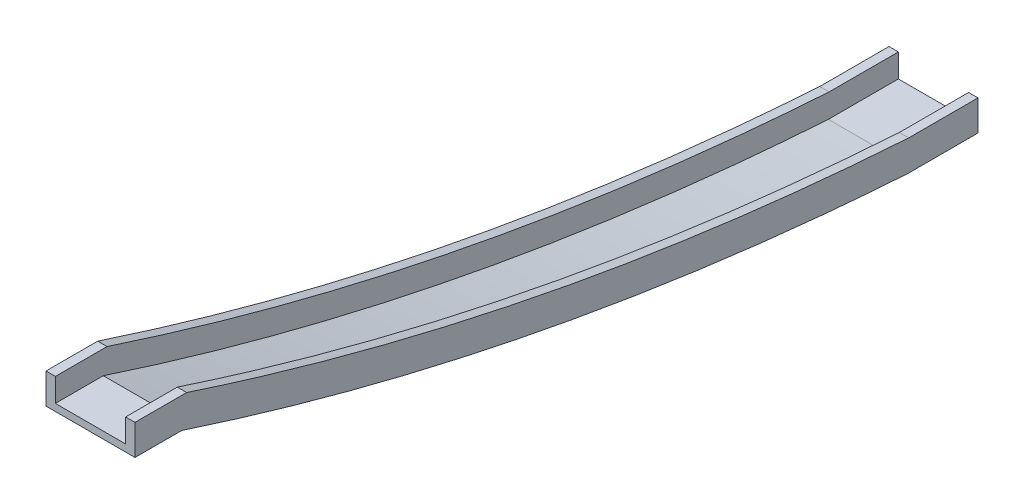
ISO-10303-21;
HEADER;
FILE_DESCRIPTION(('STEP AP214'),'2;1');
FILE_NAME('part.step','',(''),(''),'','','');
FILE_SCHEMA(('AUTOMOTIVE_DESIGN { 1 0 10303 214 1 1 1 1 }'));
ENDSEC;
DATA;
#1=APPLICATION_CONTEXT('core data for automotive mechanical design processes');
#2=APPLICATION_PROTOCOL_DEFINITION('international standard','automotive_design',2000,#1);
#3=PRODUCT_CONTEXT('',#1,'mechanical');
#4=PRODUCT('Part','Part','',(#3));
#5=PRODUCT_RELATED_PRODUCT_CATEGORY('part','',(#4));
#6=PRODUCT_DEFINITION_FORMATION('','',#4);
#7=PRODUCT_DEFINITION_CONTEXT('part definition',#1,'design');
#8=PRODUCT_DEFINITION('design','',#6,#7);
#9=PRODUCT_DEFINITION_SHAPE('','',#8);
#10=(LENGTH_UNIT() NAMED_UNIT(*) SI_UNIT(.MILLI.,.METRE.));
#11=(NAMED_UNIT(*) PLANE_ANGLE_UNIT() SI_UNIT($,.RADIAN.));
#12=(NAMED_UNIT(*) SI_UNIT($,.STERADIAN.) SOLID_ANGLE_UNIT());
#13=UNCERTAINTY_MEASURE_WITH_UNIT(LENGTH_MEASURE(1.E-05),#10,'distance_accuracy_value','');
#14=(GEOMETRIC_REPRESENTATION_CONTEXT(3) GLOBAL_UNCERTAINTY_ASSIGNED_CONTEXT((#13)) GLOBAL_UNIT_ASSIGNED_CONTEXT((#10,
#11,#12)) REPRESENTATION_CONTEXT('',''));
#15=CARTESIAN_POINT('',(0.,0.,0.));
#16=DIRECTION('',(0.,0.,1.));
#17=DIRECTION('',(1.,0.,0.));
#18=AXIS2_PLACEMENT_3D('',#15,#16,#17);
#19=CARTESIAN_POINT('',(2.,1.5,-10.2396842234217));
#20=CARTESIAN_POINT('',(2.,-7.75158947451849,-38.4498376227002));
#21=CARTESIAN_POINT('',(2.,-20.6417827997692,-89.4936099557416));
#22=CARTESIAN_POINT('',(2.,-26.9800815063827,-141.79990733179));
#23=CARTESIAN_POINT('',(2.,-28.5,-165.048979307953));
#24=CARTESIAN_POINT('',(7.,1.5,-10.2396842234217));
#25=CARTESIAN_POINT('',(7.,-7.79543489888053,-38.5835320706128));
#26=CARTESIAN_POINT('',(7.,-20.628168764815,-89.4963212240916));
#27=CARTESIAN_POINT('',(7.,-26.9744071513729,-141.71311090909));
#28=CARTESIAN_POINT('',(7.,-28.5,-165.048979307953));
#29=CARTESIAN_POINT('',(12.,1.5,-10.2396842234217));
#30=CARTESIAN_POINT('',(12.,-7.79562912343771,-38.5841243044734));
#31=CARTESIAN_POINT('',(12.,-20.6281084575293,-89.4963332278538));
#32=CARTESIAN_POINT('',(12.,-26.9743820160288,-141.712726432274));
#33=CARTESIAN_POINT('',(12.,-28.5,-165.048979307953));
#34=CARTESIAN_POINT('',(17.,1.5,-10.2396842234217));
#35=CARTESIAN_POINT('',(17.,-7.75158947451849,-38.4498376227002));
#36=CARTESIAN_POINT('',(17.,-20.6417827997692,-89.4936099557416));
#37=CARTESIAN_POINT('',(17.,-26.9800815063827,-141.79990733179));
#38=CARTESIAN_POINT('',(17.,-28.5,-165.048979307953));
#39=B_SPLINE_SURFACE_WITH_KNOTS('',3,3,((#19,#20,#21,#22,#23),(#24,#25,#26,#27,#28),(#29,#30,
#31,#32,#33),(#34,#35,#36,#37,#38)),.UNSPECIFIED.,.F.,.F.,.F.,(4,4),(4,1,4),(0.532630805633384,
0.777361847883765),(0.,0.560000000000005,1.),.UNSPECIFIED.);
#40=DIRECTION('',(-1.,0.,0.));
#41=VECTOR('',#40,1.);
#42=CARTESIAN_POINT('',(2.,-28.5,-165.048979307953));
#43=LINE('',#42,#41);
#44=CARTESIAN_POINT('',(2.,-28.5,-165.048979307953));
#45=VERTEX_POINT('',#44);
#46=CARTESIAN_POINT('',(17.,-28.5,-165.048979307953));
#47=VERTEX_POINT('',#46);
#48=EDGE_CURVE('E100',#45,#47,#43,.F.);
#49=CARTESIAN_POINT('',(2.,1.5,-10.2396842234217));
#50=CARTESIAN_POINT('',(2.,-0.0592104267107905,-14.9939167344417));
#51=CARTESIAN_POINT('',(2.,-1.56305615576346,-19.766325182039));
#52=CARTESIAN_POINT('',(2.,-4.45841545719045,-29.3460013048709));
#53=CARTESIAN_POINT('',(2.,-5.84990937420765,-34.1532749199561));
#54=CARTESIAN_POINT('',(2.,-8.5995027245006,-44.0926413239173));
#55=CARTESIAN_POINT('',(2.,-9.9504334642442,-49.226719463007));
#56=CARTESIAN_POINT('',(2.,-12.5216540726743,-59.527668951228));
#57=CARTESIAN_POINT('',(2.,-13.7419396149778,-64.6945413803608));
#58=CARTESIAN_POINT('',(2.,-16.0504108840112,-75.0582989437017));
#59=CARTESIAN_POINT('',(2.,-17.1385822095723,-80.2551872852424));
#60=CARTESIAN_POINT('',(2.,-19.1814601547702,-90.6751254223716));
#61=CARTESIAN_POINT('',(2.,-20.136168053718,-95.8981749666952));
#62=CARTESIAN_POINT('',(2.,-21.6217664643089,-104.659002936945));
#63=CARTESIAN_POINT('',(2.,-22.1893031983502,-108.190612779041));
#64=CARTESIAN_POINT('',(2.,-23.2634364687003,-115.263125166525));
#65=CARTESIAN_POINT('',(2.,-23.7700326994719,-118.804027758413));
#66=CARTESIAN_POINT('',(2.,-24.7222738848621,-125.894029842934));
#67=CARTESIAN_POINT('',(2.,-25.1679185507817,-129.44312937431));
#68=CARTESIAN_POINT('',(2.,-25.9982985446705,-136.548205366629));
#69=CARTESIAN_POINT('',(2.,-26.3830379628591,-140.10418134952));
#70=CARTESIAN_POINT('',(2.,-27.0917727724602,-147.222163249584));
#71=CARTESIAN_POINT('',(2.,-27.4157684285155,-150.784169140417));
#72=CARTESIAN_POINT('',(2.,-28.0032276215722,-157.913121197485));
#73=CARTESIAN_POINT('',(2.,-28.2666919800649,-161.480067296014));
#74=CARTESIAN_POINT('',(2.,-28.5,-165.048979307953));
#75=B_SPLINE_CURVE_WITH_KNOTS('',3,(#49,#50,#51,#52,#53,#54,#55,#56,#57,#58,#59,#60,#61,#62,#63,
#64,#65,#66,#67,#68,#69,#70,#71,#72,#73,#74),.UNSPECIFIED.,.F.,.F.,(4,2,2,2,2,2,2,2,2,2,2,2,4),
(0.,15.0098367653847,30.0222937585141,45.9470973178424,61.8724280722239,77.7994932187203,
93.7264056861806,104.456684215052,115.187016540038,125.917399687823,136.647061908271,
147.376677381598,158.106147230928),.UNSPECIFIED.);
#76=CARTESIAN_POINT('',(2.,1.5,-10.2396842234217));
#77=VERTEX_POINT('',#76);
#78=EDGE_CURVE('E23',#77,#45,#75,.T.);
#79=DIRECTION('',(1.,0.,0.));
#80=VECTOR('',#79,1.);
#81=CARTESIAN_POINT('',(2.,1.5,-10.2396842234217));
#82=LINE('',#81,#80);
#83=CARTESIAN_POINT('',(17.,1.5,-10.2396842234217));
#84=VERTEX_POINT('',#83);
#85=EDGE_CURVE('E117',#84,#77,#82,.F.);
#86=CARTESIAN_POINT('',(17.,-28.5,-165.048979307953));
#87=CARTESIAN_POINT('',(17.,-28.3367959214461,-162.552551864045));
#88=CARTESIAN_POINT('',(17.,-28.1588469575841,-160.057117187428));
#89=CARTESIAN_POINT('',(17.,-27.7733674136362,-155.068516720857));
#90=CARTESIAN_POINT('',(17.,-27.5658366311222,-152.575350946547));
#91=CARTESIAN_POINT('',(17.,-26.8986778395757,-145.099065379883));
#92=CARTESIAN_POINT('',(17.,-26.3945270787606,-140.119826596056));
#93=CARTESIAN_POINT('',(17.,-25.4321708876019,-131.631022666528));
#94=CARTESIAN_POINT('',(17.,-25.0037379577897,-128.118036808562));
#95=CARTESIAN_POINT('',(17.,-24.0871972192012,-121.099704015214));
#96=CARTESIAN_POINT('',(17.,-23.5990872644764,-117.59435735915));
#97=CARTESIAN_POINT('',(17.,-22.5631874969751,-110.592466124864));
#98=CARTESIAN_POINT('',(17.,-22.0153971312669,-107.095921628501));
#99=CARTESIAN_POINT('',(17.,-20.8601072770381,-100.112233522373));
#100=CARTESIAN_POINT('',(17.,-20.2525999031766,-96.6250912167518));
#101=CARTESIAN_POINT('',(17.,-18.9780801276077,-89.6617315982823));
#102=CARTESIAN_POINT('',(17.,-18.3110682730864,-86.1855141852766));
#103=CARTESIAN_POINT('',(17.,-16.9178277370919,-79.2449817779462));
#104=CARTESIAN_POINT('',(17.,-16.1915992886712,-75.7806667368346));
#105=CARTESIAN_POINT('',(17.,-14.6722970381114,-68.8284046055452));
#106=CARTESIAN_POINT('',(17.,-13.8785986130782,-65.3405940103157));
#107=CARTESIAN_POINT('',(17.,-12.2315158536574,-58.3790776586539));
#108=CARTESIAN_POINT('',(17.,-11.3781312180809,-54.9053719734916));
#109=CARTESIAN_POINT('',(17.,-9.61218016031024,-47.9730162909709));
#110=CARTESIAN_POINT('',(17.,-8.69961338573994,-44.514366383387));
#111=CARTESIAN_POINT('',(17.,-6.81599316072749,-37.6134889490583));
#112=CARTESIAN_POINT('',(17.,-5.84494692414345,-34.1712594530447));
#113=CARTESIAN_POINT('',(17.,-3.84490616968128,-27.3037012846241));
#114=CARTESIAN_POINT('',(17.,-2.81591198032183,-23.8783725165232));
#115=CARTESIAN_POINT('',(17.,-0.700699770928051,-17.0454980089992));
#116=CARTESIAN_POINT('',(17.,0.385517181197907,-13.6379519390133));
#117=CARTESIAN_POINT('',(17.,1.5,-10.2396842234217));
#118=B_SPLINE_CURVE_WITH_KNOTS('',3,(#86,#87,#88,#89,#90,#91,#92,#93,#94,#95,#96,#97,#98,#99,
#100,#101,#102,#103,#104,#105,#106,#107,#108,#109,#110,#111,#112,#113,#114,#115,#116,#117),
.UNSPECIFIED.,.F.,.F.,(4,2,2,2,2,2,2,2,2,2,2,2,2,2,2,4),(0.,7.5051675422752,15.0103864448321,
30.0228357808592,40.6394279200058,51.2564019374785,61.8734743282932,72.4919505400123,
83.1103291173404,93.7286659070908,104.459074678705,115.189537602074,125.920064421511,
136.64927025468,147.37841526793,158.107360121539),.UNSPECIFIED.);
#119=EDGE_CURVE('E103',#47,#84,#118,.T.);
#120=ORIENTED_EDGE('',*,*,#48,.F.);
#121=ORIENTED_EDGE('',*,*,#78,.F.);
#122=ORIENTED_EDGE('',*,*,#85,.F.);
#123=ORIENTED_EDGE('',*,*,#119,.F.);
#124=EDGE_LOOP('',(#120,#121,#122,#123));
#125=FACE_BOUND('',#124,.T.);
#126=ADVANCED_FACE('F17',(#125),#39,.T.);
#127=CARTESIAN_POINT('',(2.,-28.5,-165.048979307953));
#128=DIRECTION('',(0.,1.,0.));
#129=DIRECTION('',(-1.,0.,0.));
#130=AXIS2_PLACEMENT_3D('',#127,#128,#129);
#131=PLANE('',#130);
#132=DIRECTION('',(1.,0.,0.));
#133=VECTOR('',#132,1.);
#134=CARTESIAN_POINT('',(9.5,-28.5,-180.));
#135=LINE('',#134,#133);
#136=CARTESIAN_POINT('',(17.,-28.5,-180.));
#137=VERTEX_POINT('',#136);
#138=CARTESIAN_POINT('',(2.,-28.5,-180.));
#139=VERTEX_POINT('',#138);
#140=EDGE_CURVE('E113',#137,#139,#135,.F.);
#141=ORIENTED_EDGE('',*,*,#140,.T.);
#142=DIRECTION('',(0.,0.,1.));
#143=VECTOR('',#142,1.);
#144=CARTESIAN_POINT('',(2.,-28.5,-30.600401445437));
#145=LINE('',#144,#143);
#146=EDGE_CURVE('E110',#45,#139,#145,.F.);
#147=ORIENTED_EDGE('',*,*,#146,.F.);
#148=ORIENTED_EDGE('',*,*,#48,.T.);
#149=DIRECTION('',(0.,0.,1.));
#150=VECTOR('',#149,1.);
#151=CARTESIAN_POINT('',(17.,-28.5,-30.600401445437));
#152=LINE('',#151,#150);
#153=EDGE_CURVE('E131',#137,#47,#152,.T.);
#154=ORIENTED_EDGE('',*,*,#153,.F.);
#155=EDGE_LOOP('',(#141,#147,#148,#154));
#156=FACE_BOUND('',#155,.T.);
#157=ADVANCED_FACE('F111',(#156),#131,.T.);
#158=CARTESIAN_POINT('',(2.,6.5,-30.600401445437));
#159=DIRECTION('',(1.,0.,0.));
#160=DIRECTION('',(0.,1.,0.));
#161=AXIS2_PLACEMENT_3D('',#158,#159,#160);
#162=PLANE('',#161);
#163=DIRECTION('',(0.,0.,1.));
#164=VECTOR('',#163,1.);
#165=CARTESIAN_POINT('',(2.,6.5,-30.600401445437));
#166=LINE('',#165,#164);
#167=CARTESIAN_POINT('',(2.,6.5,0.));
#168=VERTEX_POINT('',#167);
#169=CARTESIAN_POINT('',(2.,6.5,-11.0386316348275));
#170=VERTEX_POINT('',#169);
#171=EDGE_CURVE('E371',#168,#170,#166,.F.);
#172=ORIENTED_EDGE('',*,*,#171,.F.);
#173=DIRECTION('',(0.,1.,0.));
#174=VECTOR('',#173,1.);
#175=CARTESIAN_POINT('',(2.,0.,0.));
#176=LINE('',#175,#174);
#177=CARTESIAN_POINT('',(2.,1.5,0.));
#178=VERTEX_POINT('',#177);
#179=EDGE_CURVE('E127',#168,#178,#176,.F.);
#180=ORIENTED_EDGE('',*,*,#179,.T.);
#181=DIRECTION('',(0.,0.,1.));
#182=VECTOR('',#181,1.);
#183=CARTESIAN_POINT('',(2.,1.5,-30.600401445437));
#184=LINE('',#183,#182);
#185=EDGE_CURVE('E123',#77,#178,#184,.T.);
#186=ORIENTED_EDGE('',*,*,#185,.F.);
#187=ORIENTED_EDGE('',*,*,#78,.T.);
#188=ORIENTED_EDGE('',*,*,#146,.T.);
#189=DIRECTION('',(0.,1.,0.));
#190=VECTOR('',#189,1.);
#191=CARTESIAN_POINT('',(2.,-30.,-180.));
#192=LINE('',#191,#190);
#193=CARTESIAN_POINT('',(2.,-23.5,-180.));
#194=VERTEX_POINT('',#193);
#195=EDGE_CURVE('E304',#139,#194,#192,.T.);
#196=ORIENTED_EDGE('',*,*,#195,.T.);
#197=DIRECTION('',(0.,0.,1.));
#198=VECTOR('',#197,1.);
#199=CARTESIAN_POINT('',(2.,-23.5,-165.212243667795));
#200=LINE('',#199,#198);
#201=CARTESIAN_POINT('',(2.,-23.5,-165.212243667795));
#202=VERTEX_POINT('',#201);
#203=EDGE_CURVE('E300',#202,#194,#200,.F.);
#204=ORIENTED_EDGE('',*,*,#203,.F.);
#205=CARTESIAN_POINT('',(2.,6.5,-11.0386316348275));
#206=CARTESIAN_POINT('',(2.,6.08448258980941,-12.3056301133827));
#207=CARTESIAN_POINT('',(2.,5.67278833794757,-13.5739034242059));
#208=CARTESIAN_POINT('',(2.,3.6334603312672,-19.9218805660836));
#209=CARTESIAN_POINT('',(2.,2.06360855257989,-25.0203495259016));
#210=CARTESIAN_POINT('',(2.,-0.195950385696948,-32.695629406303));
#211=CARTESIAN_POINT('',(2.,-0.93324777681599,-35.2585806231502));
#212=CARTESIAN_POINT('',(2.,-3.09712772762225,-42.96140937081));
#213=CARTESIAN_POINT('',(2.,-4.47560432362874,-48.1149577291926));
#214=CARTESIAN_POINT('',(2.,-6.44471882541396,-55.8699001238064));
#215=CARTESIAN_POINT('',(2.,-7.08463958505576,-58.4589078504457));
#216=CARTESIAN_POINT('',(2.,-8.33132968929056,-63.6448936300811));
#217=CARTESIAN_POINT('',(2.,-8.93809902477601,-66.2418716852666));
#218=CARTESIAN_POINT('',(2.,-10.7082993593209,-74.0446525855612));
#219=CARTESIAN_POINT('',(2.,-11.8215400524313,-79.2619769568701));
#220=CARTESIAN_POINT('',(2.,-13.389269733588,-87.1079357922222));
#221=CARTESIAN_POINT('',(2.,-13.8948102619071,-89.7265023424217));
#222=CARTESIAN_POINT('',(2.,-14.8716862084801,-94.9702529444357));
#223=CARTESIAN_POINT('',(2.,-15.3430188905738,-97.5954375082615));
#224=CARTESIAN_POINT('',(2.,-16.2513126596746,-102.851753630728));
#225=CARTESIAN_POINT('',(2.,-16.688273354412,-105.482885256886));
#226=CARTESIAN_POINT('',(2.,-17.9475961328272,-113.384444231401));
#227=CARTESIAN_POINT('',(2.,-18.7184259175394,-118.663180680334));
#228=CARTESIAN_POINT('',(2.,-20.1227370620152,-129.238835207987));
#229=CARTESIAN_POINT('',(2.,-20.7562185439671,-134.535753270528));
#230=CARTESIAN_POINT('',(2.,-21.7708270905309,-144.060559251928));
#231=CARTESIAN_POINT('',(2.,-22.1770697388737,-148.285787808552));
#232=CARTESIAN_POINT('',(2.,-22.903212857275,-156.743816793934));
#233=CARTESIAN_POINT('',(2.,-23.2231101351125,-160.976617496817));
#234=CARTESIAN_POINT('',(2.,-23.5,-165.212243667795));
#235=B_SPLINE_CURVE_WITH_KNOTS('',3,(#205,#206,#207,#208,#209,#210,#211,#212,#213,#214,#215,
#216,#217,#218,#219,#220,#221,#222,#223,#224,#225,#226,#227,#228,#229,#230,#231,#232,#233,#234),
.UNSPECIFIED.,.F.,.F.,(4,2,2,2,2,2,2,2,2,2,2,2,2,2,4),(0.,4.00022890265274,20.0022677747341,
28.0028433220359,44.0049493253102,52.0055325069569,60.0061178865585,76.0082949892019,
84.0088857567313,92.0101157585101,100.011437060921,116.013637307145,132.015823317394,
144.749100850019,157.482849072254),.UNSPECIFIED.);
#236=EDGE_CURVE('E187',#170,#202,#235,.T.);
#237=ORIENTED_EDGE('',*,*,#236,.F.);
#238=EDGE_LOOP('',(#172,#180,#186,#187,#188,#196,#204,#237));
#239=FACE_BOUND('',#238,.T.);
#240=ADVANCED_FACE('F120',(#239),#162,.T.);
#241=CARTESIAN_POINT('',(2.,1.5,-30.600401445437));
#242=DIRECTION('',(0.,1.,0.));
#243=DIRECTION('',(0.,0.,1.));
#244=AXIS2_PLACEMENT_3D('',#241,#242,#243);
#245=PLANE('',#244);
#246=ORIENTED_EDGE('',*,*,#185,.T.);
#247=DIRECTION('',(-1.,0.,0.));
#248=VECTOR('',#247,1.);
#249=CARTESIAN_POINT('',(0.,1.5,0.));
#250=LINE('',#249,#248);
#251=CARTESIAN_POINT('',(17.,1.5,0.));
#252=VERTEX_POINT('',#251);
#253=EDGE_CURVE('E383',#178,#252,#250,.F.);
#254=ORIENTED_EDGE('',*,*,#253,.T.);
#255=DIRECTION('',(0.,0.,1.));
#256=VECTOR('',#255,1.);
#257=CARTESIAN_POINT('',(17.,1.5,-30.600401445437));
#258=LINE('',#257,#256);
#259=EDGE_CURVE('E136',#84,#252,#258,.T.);
#260=ORIENTED_EDGE('',*,*,#259,.F.);
#261=ORIENTED_EDGE('',*,*,#85,.T.);
#262=EDGE_LOOP('',(#246,#254,#260,#261));
#263=FACE_BOUND('',#262,.T.);
#264=ADVANCED_FACE('F134',(#263),#245,.T.);
#265=CARTESIAN_POINT('',(17.,1.5,-30.600401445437));
#266=DIRECTION('',(-1.,0.,0.));
#267=DIRECTION('',(0.,0.,1.));
#268=AXIS2_PLACEMENT_3D('',#265,#266,#267);
#269=PLANE('',#268);
#270=ORIENTED_EDGE('',*,*,#259,.T.);
#271=DIRECTION('',(0.,1.,0.));
#272=VECTOR('',#271,1.);
#273=CARTESIAN_POINT('',(17.,0.,0.));
#274=LINE('',#273,#272);
#275=CARTESIAN_POINT('',(17.,6.5,0.));
#276=VERTEX_POINT('',#275);
#277=EDGE_CURVE('E335',#252,#276,#274,.T.);
#278=ORIENTED_EDGE('',*,*,#277,.T.);
#279=DIRECTION('',(0.,0.,1.));
#280=VECTOR('',#279,1.);
#281=CARTESIAN_POINT('',(17.,6.5,-30.600401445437));
#282=LINE('',#281,#280);
#283=CARTESIAN_POINT('',(17.,6.5,-11.0386316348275));
#284=VERTEX_POINT('',#283);
#285=EDGE_CURVE('E327',#284,#276,#282,.T.);
#286=ORIENTED_EDGE('',*,*,#285,.F.);
#287=CARTESIAN_POINT('',(17.,-23.5,-165.212243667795));
#288=CARTESIAN_POINT('',(17.,-23.4130155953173,-163.881688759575));
#289=CARTESIAN_POINT('',(17.,-23.3217876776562,-162.551397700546));
#290=CARTESIAN_POINT('',(17.,-22.8443726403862,-155.901007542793));
#291=CARTESIAN_POINT('',(17.,-22.3944369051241,-150.585333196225));
#292=CARTESIAN_POINT('',(17.,-21.3576652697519,-139.965609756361));
#293=CARTESIAN_POINT('',(17.,-20.7707831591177,-134.661565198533));
#294=CARTESIAN_POINT('',(17.,-19.4597055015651,-124.070475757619));
#295=CARTESIAN_POINT('',(17.,-18.7355102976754,-118.783430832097));
#296=CARTESIAN_POINT('',(17.,-17.1498270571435,-108.231699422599));
#297=CARTESIAN_POINT('',(17.,-16.2883847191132,-102.967006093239));
#298=CARTESIAN_POINT('',(17.,-14.8931910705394,-95.0885676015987));
#299=CARTESIAN_POINT('',(17.,-14.4109718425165,-92.4656049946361));
#300=CARTESIAN_POINT('',(17.,-13.4123656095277,-87.2262006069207));
#301=CARTESIAN_POINT('',(17.,-12.8959786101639,-84.6097588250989));
#302=CARTESIAN_POINT('',(17.,-11.2958218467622,-76.7703662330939));
#303=CARTESIAN_POINT('',(17.,-10.1611145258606,-71.5576766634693));
#304=CARTESIAN_POINT('',(17.,-8.3590236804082,-63.7622616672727));
#305=CARTESIAN_POINT('',(17.,-7.74167617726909,-61.167808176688));
#306=CARTESIAN_POINT('',(17.,-5.83993703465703,-53.396127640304));
#307=CARTESIAN_POINT('',(17.,-4.50591700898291,-48.230893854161));
#308=CARTESIAN_POINT('',(17.,-2.40792678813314,-40.5098445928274));
#309=CARTESIAN_POINT('',(17.,-1.69245998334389,-37.9407063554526));
#310=CARTESIAN_POINT('',(17.,-0.229559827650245,-32.8115352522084));
#311=CARTESIAN_POINT('',(17.,0.51787351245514,-30.2515023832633));
#312=CARTESIAN_POINT('',(17.,2.94630314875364,-22.1208104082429));
#313=CARTESIAN_POINT('',(17.,4.68664218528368,-16.567805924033));
#314=CARTESIAN_POINT('',(17.,6.5,-11.0386316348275));
#315=B_SPLINE_CURVE_WITH_KNOTS('',3,(#287,#288,#289,#290,#291,#292,#293,#294,#295,#296,#297,
#298,#299,#300,#301,#302,#303,#304,#305,#306,#307,#308,#309,#310,#311,#312,#313,#314),
.UNSPECIFIED.,.F.,.F.,(4,2,2,2,2,2,2,2,2,2,2,2,2,4),(0.,4.00021580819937,20.0023108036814,
36.0098132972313,52.0172758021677,68.0194194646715,76.0199813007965,84.0205418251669,
100.022663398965,108.023218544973,124.025290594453,132.025838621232,140.026383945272,
157.482341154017),.UNSPECIFIED.);
#316=CARTESIAN_POINT('',(17.,-23.5,-165.212243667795));
#317=VERTEX_POINT('',#316);
#318=EDGE_CURVE('E179',#317,#284,#315,.T.);
#319=ORIENTED_EDGE('',*,*,#318,.F.);
#320=DIRECTION('',(0.,0.,1.));
#321=VECTOR('',#320,1.);
#322=CARTESIAN_POINT('',(17.,-23.5,-165.212243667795));
#323=LINE('',#322,#321);
#324=CARTESIAN_POINT('',(17.,-23.5,-180.));
#325=VERTEX_POINT('',#324);
#326=EDGE_CURVE('E340',#325,#317,#323,.T.);
#327=ORIENTED_EDGE('',*,*,#326,.F.);
#328=DIRECTION('',(0.,1.,0.));
#329=VECTOR('',#328,1.);
#330=CARTESIAN_POINT('',(17.,-30.,-180.));
#331=LINE('',#330,#329);
#332=EDGE_CURVE('E408',#325,#137,#331,.F.);
#333=ORIENTED_EDGE('',*,*,#332,.T.);
#334=ORIENTED_EDGE('',*,*,#153,.T.);
#335=ORIENTED_EDGE('',*,*,#119,.T.);
#336=EDGE_LOOP('',(#270,#278,#286,#319,#327,#333,#334,#335));
#337=FACE_BOUND('',#336,.T.);
#338=ADVANCED_FACE('F191',(#337),#269,.T.);
#339=CARTESIAN_POINT('',(0.,6.5,-30.600401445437));
#340=DIRECTION('',(0.,1.,0.));
#341=DIRECTION('',(0.,0.,1.));
#342=AXIS2_PLACEMENT_3D('',#339,#340,#341);
#343=PLANE('',#342);
#344=DIRECTION('',(0.,0.,1.));
#345=VECTOR('',#344,1.);
#346=CARTESIAN_POINT('',(0.,6.5,-30.600401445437));
#347=LINE('',#346,#345);
#348=CARTESIAN_POINT('',(0.,6.5,0.));
#349=VERTEX_POINT('',#348);
#350=CARTESIAN_POINT('',(0.,6.5,-11.0386316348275));
#351=VERTEX_POINT('',#350);
#352=EDGE_CURVE('E316',#349,#351,#347,.F.);
#353=ORIENTED_EDGE('',*,*,#352,.F.);
#354=DIRECTION('',(-1.,0.,0.));
#355=VECTOR('',#354,1.);
#356=CARTESIAN_POINT('',(0.,6.5,0.));
#357=LINE('',#356,#355);
#358=EDGE_CURVE('E372',#349,#168,#357,.F.);
#359=ORIENTED_EDGE('',*,*,#358,.T.);
#360=ORIENTED_EDGE('',*,*,#171,.T.);
#361=DIRECTION('',(1.,0.,0.));
#362=VECTOR('',#361,1.);
#363=CARTESIAN_POINT('',(1.,6.5,-11.0386316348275));
#364=LINE('',#363,#362);
#365=EDGE_CURVE('E368',#351,#170,#364,.T.);
#366=ORIENTED_EDGE('',*,*,#365,.F.);
#367=EDGE_LOOP('',(#353,#359,#360,#366));
#368=FACE_BOUND('',#367,.T.);
#369=ADVANCED_FACE('F196',(#368),#343,.T.);
#370=CARTESIAN_POINT('',(0.,6.5,-11.0386316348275));
#371=CARTESIAN_POINT('',(0.,-2.71161727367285,-39.1269009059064));
#372=CARTESIAN_POINT('',(0.,-15.6406814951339,-89.8925965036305));
#373=CARTESIAN_POINT('',(0.,-21.9852545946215,-142.042300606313));
#374=CARTESIAN_POINT('',(0.,-23.5,-165.212243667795));
#375=CARTESIAN_POINT('',(0.666666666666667,6.5,-11.0386316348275));
#376=CARTESIAN_POINT('',(0.666666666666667,-2.70959676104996,-39.1207399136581));
#377=CARTESIAN_POINT('',(0.666666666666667,-15.6413088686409,-89.8924716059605));
#378=CARTESIAN_POINT('',(0.666666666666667,-21.9855160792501,-142.046300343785));
#379=CARTESIAN_POINT('',(0.666666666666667,-23.5,-165.212243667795));
#380=CARTESIAN_POINT('',(1.33333333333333,6.5,-11.0386316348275));
#381=CARTESIAN_POINT('',(1.33333333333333,-2.70948546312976,-39.1204005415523));
#382=CARTESIAN_POINT('',(1.33333333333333,-15.6413434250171,-89.8924646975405));
#383=CARTESIAN_POINT('',(1.33333333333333,-21.9855304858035,-142.046520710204));
#384=CARTESIAN_POINT('',(1.33333333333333,-23.5,-165.212243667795));
#385=CARTESIAN_POINT('',(2.,6.5,-11.0386316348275));
#386=CARTESIAN_POINT('',(2.,-2.71161727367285,-39.1269009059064));
#387=CARTESIAN_POINT('',(2.,-15.6406814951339,-89.8925965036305));
#388=CARTESIAN_POINT('',(2.,-21.9852545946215,-142.042300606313));
#389=CARTESIAN_POINT('',(2.,-23.5,-165.212243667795));
#390=B_SPLINE_SURFACE_WITH_KNOTS('',3,3,((#370,#371,#372,#373,#374),(#375,#376,#377,#378,#379),
(#380,#381,#382,#383,#384),(#385,#386,#387,#388,#389)),.UNSPECIFIED.,.F.,.F.,.F.,(4,4),(4,1,4),
(0.417388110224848,0.450018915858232),(0.,0.560000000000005,1.),.UNSPECIFIED.);
#391=DIRECTION('',(1.,0.,0.));
#392=VECTOR('',#391,1.);
#393=CARTESIAN_POINT('',(0.,-23.5,-165.212243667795));
#394=LINE('',#393,#392);
#395=CARTESIAN_POINT('',(0.,-23.5,-165.212243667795));
#396=VERTEX_POINT('',#395);
#397=EDGE_CURVE('E366',#396,#202,#394,.T.);
#398=CARTESIAN_POINT('',(0.,6.5,-11.0386316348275));
#399=CARTESIAN_POINT('',(0.,6.08448258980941,-12.3056301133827));
#400=CARTESIAN_POINT('',(0.,5.67278833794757,-13.5739034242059));
#401=CARTESIAN_POINT('',(0.,3.6334603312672,-19.9218805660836));
#402=CARTESIAN_POINT('',(0.,2.06360855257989,-25.0203495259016));
#403=CARTESIAN_POINT('',(0.,-0.195950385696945,-32.695629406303));
#404=CARTESIAN_POINT('',(0.,-0.933247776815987,-35.2585806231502));
#405=CARTESIAN_POINT('',(0.,-3.09712772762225,-42.96140937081));
#406=CARTESIAN_POINT('',(0.,-4.47560432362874,-48.1149577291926));
#407=CARTESIAN_POINT('',(0.,-6.44471882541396,-55.8699001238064));
#408=CARTESIAN_POINT('',(0.,-7.08463958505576,-58.4589078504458));
#409=CARTESIAN_POINT('',(0.,-8.33132968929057,-63.6448936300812));
#410=CARTESIAN_POINT('',(0.,-8.93809902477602,-66.2418716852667));
#411=CARTESIAN_POINT('',(0.,-10.7082993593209,-74.0446525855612));
#412=CARTESIAN_POINT('',(0.,-11.8215400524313,-79.2619769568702));
#413=CARTESIAN_POINT('',(0.,-13.389269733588,-87.1079357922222));
#414=CARTESIAN_POINT('',(0.,-13.8948102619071,-89.7265023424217));
#415=CARTESIAN_POINT('',(0.,-14.8716862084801,-94.9702529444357));
#416=CARTESIAN_POINT('',(0.,-15.3430188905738,-97.5954375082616));
#417=CARTESIAN_POINT('',(0.,-16.2513126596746,-102.851753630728));
#418=CARTESIAN_POINT('',(0.,-16.688273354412,-105.482885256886));
#419=CARTESIAN_POINT('',(0.,-17.9475961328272,-113.384444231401));
#420=CARTESIAN_POINT('',(0.,-18.7184259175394,-118.663180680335));
#421=CARTESIAN_POINT('',(0.,-20.1227370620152,-129.238835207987));
#422=CARTESIAN_POINT('',(0.,-20.7562185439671,-134.535753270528));
#423=CARTESIAN_POINT('',(0.,-21.7708270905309,-144.060559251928));
#424=CARTESIAN_POINT('',(0.,-22.1770697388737,-148.285787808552));
#425=CARTESIAN_POINT('',(0.,-22.9032128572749,-156.743816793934));
#426=CARTESIAN_POINT('',(0.,-23.2231101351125,-160.976617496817));
#427=CARTESIAN_POINT('',(0.,-23.5,-165.212243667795));
#428=B_SPLINE_CURVE_WITH_KNOTS('',3,(#398,#399,#400,#401,#402,#403,#404,#405,#406,#407,#408,
#409,#410,#411,#412,#413,#414,#415,#416,#417,#418,#419,#420,#421,#422,#423,#424,#425,#426,#427),
.UNSPECIFIED.,.F.,.F.,(4,2,2,2,2,2,2,2,2,2,2,2,2,2,4),(0.,4.00022890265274,20.0022677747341,
28.0028433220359,44.0049493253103,52.0055325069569,60.0061178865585,76.0082949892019,
84.0088857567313,92.0101157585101,100.011437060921,116.013637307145,132.015823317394,
144.749100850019,157.482849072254),.UNSPECIFIED.);
#429=EDGE_CURVE('E151',#351,#396,#428,.T.);
#430=ORIENTED_EDGE('',*,*,#397,.F.);
#431=ORIENTED_EDGE('',*,*,#429,.F.);
#432=ORIENTED_EDGE('',*,*,#365,.T.);
#433=ORIENTED_EDGE('',*,*,#236,.T.);
#434=EDGE_LOOP('',(#430,#431,#432,#433));
#435=FACE_BOUND('',#434,.T.);
#436=ADVANCED_FACE('F169',(#435),#390,.T.);
#437=CARTESIAN_POINT('',(0.,-23.5,-165.212243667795));
#438=DIRECTION('',(0.,1.,0.));
#439=DIRECTION('',(0.,0.,1.));
#440=AXIS2_PLACEMENT_3D('',#437,#438,#439);
#441=PLANE('',#440);
#442=DIRECTION('',(1.,0.,0.));
#443=VECTOR('',#442,1.);
#444=CARTESIAN_POINT('',(9.5,-23.5,-180.));
#445=LINE('',#444,#443);
#446=CARTESIAN_POINT('',(0.,-23.5,-180.));
#447=VERTEX_POINT('',#446);
#448=EDGE_CURVE('E292',#194,#447,#445,.F.);
#449=ORIENTED_EDGE('',*,*,#448,.T.);
#450=DIRECTION('',(0.,0.,1.));
#451=VECTOR('',#450,1.);
#452=CARTESIAN_POINT('',(0.,-23.5,-30.600401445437));
#453=LINE('',#452,#451);
#454=EDGE_CURVE('E296',#396,#447,#453,.F.);
#455=ORIENTED_EDGE('',*,*,#454,.F.);
#456=ORIENTED_EDGE('',*,*,#397,.T.);
#457=ORIENTED_EDGE('',*,*,#203,.T.);
#458=EDGE_LOOP('',(#449,#455,#456,#457));
#459=FACE_BOUND('',#458,.T.);
#460=ADVANCED_FACE('F280',(#459),#441,.T.);
#461=CARTESIAN_POINT('',(9.5,-30.,-180.));
#462=DIRECTION('',(0.,0.,1.));
#463=DIRECTION('',(1.,0.,0.));
#464=AXIS2_PLACEMENT_3D('',#461,#462,#463);
#465=PLANE('',#464);
#466=DIRECTION('',(0.,1.,0.));
#467=VECTOR('',#466,1.);
#468=CARTESIAN_POINT('',(0.,0.,-180.));
#469=LINE('',#468,#467);
#470=CARTESIAN_POINT('',(0.,-30.,-180.));
#471=VERTEX_POINT('',#470);
#472=EDGE_CURVE('E308',#447,#471,#469,.F.);
#473=ORIENTED_EDGE('',*,*,#472,.F.);
#474=ORIENTED_EDGE('',*,*,#448,.F.);
#475=ORIENTED_EDGE('',*,*,#195,.F.);
#476=ORIENTED_EDGE('',*,*,#140,.F.);
#477=ORIENTED_EDGE('',*,*,#332,.F.);
#478=DIRECTION('',(1.,0.,0.));
#479=VECTOR('',#478,1.);
#480=CARTESIAN_POINT('',(17.,-23.5,-180.));
#481=LINE('',#480,#479);
#482=CARTESIAN_POINT('',(19.,-23.5,-180.));
#483=VERTEX_POINT('',#482);
#484=EDGE_CURVE('E303',#483,#325,#481,.F.);
#485=ORIENTED_EDGE('',*,*,#484,.F.);
#486=DIRECTION('',(0.,1.,0.));
#487=VECTOR('',#486,1.);
#488=CARTESIAN_POINT('',(19.,6.5,-180.));
#489=LINE('',#488,#487);
#490=CARTESIAN_POINT('',(19.,-30.,-180.));
#491=VERTEX_POINT('',#490);
#492=EDGE_CURVE('E345',#491,#483,#489,.T.);
#493=ORIENTED_EDGE('',*,*,#492,.F.);
#494=DIRECTION('',(1.,0.,0.));
#495=VECTOR('',#494,1.);
#496=CARTESIAN_POINT('',(19.,-30.,-180.));
#497=LINE('',#496,#495);
#498=EDGE_CURVE('E246',#471,#491,#497,.T.);
#499=ORIENTED_EDGE('',*,*,#498,.F.);
#500=EDGE_LOOP('',(#473,#474,#475,#476,#477,#485,#493,#499));
#501=FACE_BOUND('',#500,.T.);
#502=ADVANCED_FACE('F277',(#501),#465,.F.);
#503=CARTESIAN_POINT('',(17.,-23.5,-165.212243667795));
#504=DIRECTION('',(0.,1.,0.));
#505=DIRECTION('',(0.,0.,1.));
#506=AXIS2_PLACEMENT_3D('',#503,#504,#505);
#507=PLANE('',#506);
#508=ORIENTED_EDGE('',*,*,#484,.T.);
#509=ORIENTED_EDGE('',*,*,#326,.T.);
#510=DIRECTION('',(-1.,0.,0.));
#511=VECTOR('',#510,1.);
#512=CARTESIAN_POINT('',(18.,-23.5,-165.212243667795));
#513=LINE('',#512,#511);
#514=CARTESIAN_POINT('',(19.,-23.5,-165.212243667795));
#515=VERTEX_POINT('',#514);
#516=EDGE_CURVE('E186',#515,#317,#513,.T.);
#517=ORIENTED_EDGE('',*,*,#516,.F.);
#518=DIRECTION('',(0.,0.,-1.));
#519=VECTOR('',#518,1.);
#520=CARTESIAN_POINT('',(19.,-23.5,-30.600401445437));
#521=LINE('',#520,#519);
#522=EDGE_CURVE('E150',#483,#515,#521,.F.);
#523=ORIENTED_EDGE('',*,*,#522,.F.);
#524=EDGE_LOOP('',(#508,#509,#517,#523));
#525=FACE_BOUND('',#524,.T.);
#526=ADVANCED_FACE('F167',(#525),#507,.T.);
#527=CARTESIAN_POINT('',(17.,6.5,-11.0386316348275));
#528=CARTESIAN_POINT('',(17.,-2.71161727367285,-39.1269009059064));
#529=CARTESIAN_POINT('',(17.,-15.6406814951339,-89.8925965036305));
#530=CARTESIAN_POINT('',(17.,-21.9852545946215,-142.042300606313));
#531=CARTESIAN_POINT('',(17.,-23.5,-165.212243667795));
#532=CARTESIAN_POINT('',(17.6666666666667,6.5,-11.0386316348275));
#533=CARTESIAN_POINT('',(17.6666666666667,-2.70956348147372,-39.1206384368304));
#534=CARTESIAN_POINT('',(17.6666666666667,-15.6413192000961,-89.8924695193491));
#535=CARTESIAN_POINT('',(17.6666666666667,-21.9855203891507,-142.046366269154));
#536=CARTESIAN_POINT('',(17.6666666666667,-23.5,-165.212243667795));
#537=CARTESIAN_POINT('',(18.3333333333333,6.5,-11.0386316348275));
#538=CARTESIAN_POINT('',(18.3333333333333,-2.70980420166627,-39.1213724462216));
#539=CARTESIAN_POINT('',(18.3333333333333,-15.6412444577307,-89.8924844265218));
#540=CARTESIAN_POINT('',(18.3333333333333,-21.9854892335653,-142.045889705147));
#541=CARTESIAN_POINT('',(18.3333333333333,-23.5,-165.212243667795));
#542=CARTESIAN_POINT('',(19.,6.5,-11.0386316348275));
#543=CARTESIAN_POINT('',(19.,-2.71161727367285,-39.1269009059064));
#544=CARTESIAN_POINT('',(19.,-15.6406814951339,-89.8925965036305));
#545=CARTESIAN_POINT('',(19.,-21.9852545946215,-142.042300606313));
#546=CARTESIAN_POINT('',(19.,-23.5,-165.212243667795));
#547=B_SPLINE_SURFACE_WITH_KNOTS('',3,3,((#527,#528,#529,#530,#531),(#532,#533,#534,#535,#536),
(#537,#538,#539,#540,#541),(#542,#543,#544,#545,#546)),.UNSPECIFIED.,.F.,.F.,.F.,(4,4),(4,1,4),
(0.859973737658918,0.892604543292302),(0.,0.560000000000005,1.),.UNSPECIFIED.);
#548=DIRECTION('',(1.,0.,0.));
#549=VECTOR('',#548,1.);
#550=CARTESIAN_POINT('',(17.,6.5,-11.0386316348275));
#551=LINE('',#550,#549);
#552=CARTESIAN_POINT('',(19.,6.5,-11.0386316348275));
#553=VERTEX_POINT('',#552);
#554=EDGE_CURVE('E185',#553,#284,#551,.F.);
#555=CARTESIAN_POINT('',(19.,-23.5,-165.212243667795));
#556=CARTESIAN_POINT('',(19.,-23.4130155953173,-163.881688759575));
#557=CARTESIAN_POINT('',(19.,-23.3217876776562,-162.551397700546));
#558=CARTESIAN_POINT('',(19.,-22.8443726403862,-155.901007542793));
#559=CARTESIAN_POINT('',(19.,-22.3944369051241,-150.585333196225));
#560=CARTESIAN_POINT('',(19.,-21.3576652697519,-139.965609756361));
#561=CARTESIAN_POINT('',(19.,-20.7707831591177,-134.661565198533));
#562=CARTESIAN_POINT('',(19.,-19.4597055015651,-124.070475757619));
#563=CARTESIAN_POINT('',(19.,-18.7355102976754,-118.783430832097));
#564=CARTESIAN_POINT('',(19.,-17.1498270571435,-108.231699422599));
#565=CARTESIAN_POINT('',(19.,-16.2883847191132,-102.967006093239));
#566=CARTESIAN_POINT('',(19.,-14.8931910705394,-95.0885676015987));
#567=CARTESIAN_POINT('',(19.,-14.4109718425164,-92.4656049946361));
#568=CARTESIAN_POINT('',(19.,-13.4123656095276,-87.2262006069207));
#569=CARTESIAN_POINT('',(19.,-12.8959786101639,-84.6097588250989));
#570=CARTESIAN_POINT('',(19.,-11.2958218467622,-76.7703662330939));
#571=CARTESIAN_POINT('',(19.,-10.1611145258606,-71.5576766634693));
#572=CARTESIAN_POINT('',(19.,-8.35902368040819,-63.7622616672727));
#573=CARTESIAN_POINT('',(19.,-7.74167617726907,-61.167808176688));
#574=CARTESIAN_POINT('',(19.,-5.83993703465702,-53.396127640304));
#575=CARTESIAN_POINT('',(19.,-4.5059170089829,-48.230893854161));
#576=CARTESIAN_POINT('',(19.,-2.40792678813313,-40.5098445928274));
#577=CARTESIAN_POINT('',(19.,-1.69245998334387,-37.9407063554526));
#578=CARTESIAN_POINT('',(19.,-0.229559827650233,-32.8115352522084));
#579=CARTESIAN_POINT('',(19.,0.517873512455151,-30.2515023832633));
#580=CARTESIAN_POINT('',(19.,2.94630314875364,-22.1208104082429));
#581=CARTESIAN_POINT('',(19.,4.68664218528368,-16.567805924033));
#582=CARTESIAN_POINT('',(19.,6.5,-11.0386316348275));
#583=B_SPLINE_CURVE_WITH_KNOTS('',3,(#555,#556,#557,#558,#559,#560,#561,#562,#563,#564,#565,
#566,#567,#568,#569,#570,#571,#572,#573,#574,#575,#576,#577,#578,#579,#580,#581,#582),
.UNSPECIFIED.,.F.,.F.,(4,2,2,2,2,2,2,2,2,2,2,2,2,4),(0.,4.00021580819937,20.0023108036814,
36.0098132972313,52.0172758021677,68.0194194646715,76.0199813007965,84.0205418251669,
100.022663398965,108.023218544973,124.025290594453,132.025838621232,140.026383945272,
157.482341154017),.UNSPECIFIED.);
#584=EDGE_CURVE('E142',#515,#553,#583,.T.);
#585=ORIENTED_EDGE('',*,*,#516,.T.);
#586=ORIENTED_EDGE('',*,*,#318,.T.);
#587=ORIENTED_EDGE('',*,*,#554,.F.);
#588=ORIENTED_EDGE('',*,*,#584,.F.);
#589=EDGE_LOOP('',(#585,#586,#587,#588));
#590=FACE_BOUND('',#589,.T.);
#591=ADVANCED_FACE('F161',(#590),#547,.T.);
#592=CARTESIAN_POINT('',(17.,6.5,-30.600401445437));
#593=DIRECTION('',(0.,1.,0.));
#594=DIRECTION('',(0.,0.,1.));
#595=AXIS2_PLACEMENT_3D('',#592,#593,#594);
#596=PLANE('',#595);
#597=ORIENTED_EDGE('',*,*,#285,.T.);
#598=DIRECTION('',(-1.,0.,0.));
#599=VECTOR('',#598,1.);
#600=CARTESIAN_POINT('',(0.,6.5,0.));
#601=LINE('',#600,#599);
#602=CARTESIAN_POINT('',(19.,6.5,0.));
#603=VERTEX_POINT('',#602);
#604=EDGE_CURVE('E332',#276,#603,#601,.F.);
#605=ORIENTED_EDGE('',*,*,#604,.T.);
#606=DIRECTION('',(0.,0.,-1.));
#607=VECTOR('',#606,1.);
#608=CARTESIAN_POINT('',(19.,6.5,-30.600401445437));
#609=LINE('',#608,#607);
#610=EDGE_CURVE('E149',#553,#603,#609,.F.);
#611=ORIENTED_EDGE('',*,*,#610,.F.);
#612=ORIENTED_EDGE('',*,*,#554,.T.);
#613=EDGE_LOOP('',(#597,#605,#611,#612));
#614=FACE_BOUND('',#613,.T.);
#615=ADVANCED_FACE('F166',(#614),#596,.T.);
#616=CARTESIAN_POINT('',(0.,0.,0.));
#617=DIRECTION('',(0.,0.,-1.));
#618=DIRECTION('',(-1.,0.,0.));
#619=AXIS2_PLACEMENT_3D('',#616,#617,#618);
#620=PLANE('',#619);
#621=DIRECTION('',(0.,1.,0.));
#622=VECTOR('',#621,1.);
#623=CARTESIAN_POINT('',(19.,6.5,0.));
#624=LINE('',#623,#622);
#625=CARTESIAN_POINT('',(19.,0.,0.));
#626=VERTEX_POINT('',#625);
#627=EDGE_CURVE('E243',#603,#626,#624,.F.);
#628=ORIENTED_EDGE('',*,*,#627,.F.);
#629=ORIENTED_EDGE('',*,*,#604,.F.);
#630=ORIENTED_EDGE('',*,*,#277,.F.);
#631=ORIENTED_EDGE('',*,*,#253,.F.);
#632=ORIENTED_EDGE('',*,*,#179,.F.);
#633=ORIENTED_EDGE('',*,*,#358,.F.);
#634=DIRECTION('',(0.,1.,0.));
#635=VECTOR('',#634,1.);
#636=CARTESIAN_POINT('',(0.,0.,0.));
#637=LINE('',#636,#635);
#638=CARTESIAN_POINT('',(0.,0.,0.));
#639=VERTEX_POINT('',#638);
#640=EDGE_CURVE('E247',#639,#349,#637,.T.);
#641=ORIENTED_EDGE('',*,*,#640,.F.);
#642=DIRECTION('',(1.,0.,0.));
#643=VECTOR('',#642,1.);
#644=CARTESIAN_POINT('',(19.,0.,0.));
#645=LINE('',#644,#643);
#646=EDGE_CURVE('E322',#626,#639,#645,.F.);
#647=ORIENTED_EDGE('',*,*,#646,.F.);
#648=EDGE_LOOP('',(#628,#629,#630,#631,#632,#633,#641,#647));
#649=FACE_BOUND('',#648,.T.);
#650=ADVANCED_FACE('F267',(#649),#620,.F.);
#651=CARTESIAN_POINT('',(19.,0.,-30.600401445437));
#652=DIRECTION('',(0.,-1.,0.));
#653=DIRECTION('',(1.,0.,0.));
#654=AXIS2_PLACEMENT_3D('',#651,#652,#653);
#655=PLANE('',#654);
#656=DIRECTION('',(0.,0.,-1.));
#657=VECTOR('',#656,1.);
#658=CARTESIAN_POINT('',(19.,0.,-30.600401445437));
#659=LINE('',#658,#657);
#660=CARTESIAN_POINT('',(19.,0.,-10.));
#661=VERTEX_POINT('',#660);
#662=EDGE_CURVE('E351',#626,#661,#659,.T.);
#663=ORIENTED_EDGE('',*,*,#662,.F.);
#664=ORIENTED_EDGE('',*,*,#646,.T.);
#665=DIRECTION('',(0.,0.,1.));
#666=VECTOR('',#665,1.);
#667=CARTESIAN_POINT('',(0.,0.,-30.600401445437));
#668=LINE('',#667,#666);
#669=CARTESIAN_POINT('',(0.,0.,-10.));
#670=VERTEX_POINT('',#669);
#671=EDGE_CURVE('E251',#670,#639,#668,.T.);
#672=ORIENTED_EDGE('',*,*,#671,.F.);
#673=DIRECTION('',(-1.,0.,0.));
#674=VECTOR('',#673,1.);
#675=CARTESIAN_POINT('',(9.5,0.,-10.));
#676=LINE('',#675,#674);
#677=EDGE_CURVE('E236',#661,#670,#676,.T.);
#678=ORIENTED_EDGE('',*,*,#677,.F.);
#679=EDGE_LOOP('',(#663,#664,#672,#678));
#680=FACE_BOUND('',#679,.T.);
#681=ADVANCED_FACE('F262',(#680),#655,.T.);
#682=CARTESIAN_POINT('',(0.,0.,-30.600401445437));
#683=DIRECTION('',(-1.,0.,0.));
#684=DIRECTION('',(0.,0.,1.));
#685=AXIS2_PLACEMENT_3D('',#682,#683,#684);
#686=PLANE('',#685);
#687=ORIENTED_EDGE('',*,*,#671,.T.);
#688=ORIENTED_EDGE('',*,*,#640,.T.);
#689=ORIENTED_EDGE('',*,*,#352,.T.);
#690=ORIENTED_EDGE('',*,*,#429,.T.);
#691=ORIENTED_EDGE('',*,*,#454,.T.);
#692=ORIENTED_EDGE('',*,*,#472,.T.);
#693=DIRECTION('',(0.,0.,1.));
#694=VECTOR('',#693,1.);
#695=CARTESIAN_POINT('',(0.,-30.,-165.));
#696=LINE('',#695,#694);
#697=CARTESIAN_POINT('',(0.,-30.,-165.));
#698=VERTEX_POINT('',#697);
#699=EDGE_CURVE('E244',#698,#471,#696,.F.);
#700=ORIENTED_EDGE('',*,*,#699,.F.);
#701=CARTESIAN_POINT('',(0.,-30.,-165.));
#702=CARTESIAN_POINT('',(0.,-24.8131687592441,-85.6608687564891));
#703=CARTESIAN_POINT('',(0.,0.,-10.));
#704=B_SPLINE_CURVE_WITH_KNOTS('',2,(#701,#702,#703),.UNSPECIFIED.,.F.,.F.,(3,3),(0.,1.),.UNSPECIFIED.);
#705=EDGE_CURVE('E233',#670,#698,#704,.F.);
#706=ORIENTED_EDGE('',*,*,#705,.F.);
#707=EDGE_LOOP('',(#687,#688,#689,#690,#691,#692,#700,#706));
#708=FACE_BOUND('',#707,.T.);
#709=ADVANCED_FACE('F253',(#708),#686,.T.);
#710=CARTESIAN_POINT('',(19.,-30.,-165.));
#711=DIRECTION('',(0.,-1.,0.));
#712=DIRECTION('',(1.,0.,0.));
#713=AXIS2_PLACEMENT_3D('',#710,#711,#712);
#714=PLANE('',#713);
#715=ORIENTED_EDGE('',*,*,#498,.T.);
#716=DIRECTION('',(0.,0.,-1.));
#717=VECTOR('',#716,1.);
#718=CARTESIAN_POINT('',(19.,-30.,-30.600401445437));
#719=LINE('',#718,#717);
#720=CARTESIAN_POINT('',(19.,-30.,-165.));
#721=VERTEX_POINT('',#720);
#722=EDGE_CURVE('E43',#721,#491,#719,.T.);
#723=ORIENTED_EDGE('',*,*,#722,.F.);
#724=DIRECTION('',(1.,0.,0.));
#725=VECTOR('',#724,1.);
#726=CARTESIAN_POINT('',(9.5,-30.,-165.));
#727=LINE('',#726,#725);
#728=EDGE_CURVE('E34',#698,#721,#727,.T.);
#729=ORIENTED_EDGE('',*,*,#728,.F.);
#730=ORIENTED_EDGE('',*,*,#699,.T.);
#731=EDGE_LOOP('',(#715,#723,#729,#730));
#732=FACE_BOUND('',#731,.T.);
#733=ADVANCED_FACE('F227',(#732),#714,.T.);
#734=CARTESIAN_POINT('',(19.,6.5,-30.600401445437));
#735=DIRECTION('',(1.,0.,0.));
#736=DIRECTION('',(0.,0.,-1.));
#737=AXIS2_PLACEMENT_3D('',#734,#735,#736);
#738=PLANE('',#737);
#739=ORIENTED_EDGE('',*,*,#610,.T.);
#740=ORIENTED_EDGE('',*,*,#627,.T.);
#741=ORIENTED_EDGE('',*,*,#662,.T.);
#742=CARTESIAN_POINT('',(19.,0.,-10.));
#743=CARTESIAN_POINT('',(19.,-24.8131687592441,-85.6608687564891));
#744=CARTESIAN_POINT('',(19.,-30.,-165.));
#745=B_SPLINE_CURVE_WITH_KNOTS('',2,(#742,#743,#744),.UNSPECIFIED.,.F.,.F.,(3,3),(0.,1.),.UNSPECIFIED.);
#746=EDGE_CURVE('E11',#721,#661,#745,.F.);
#747=ORIENTED_EDGE('',*,*,#746,.F.);
#748=ORIENTED_EDGE('',*,*,#722,.T.);
#749=ORIENTED_EDGE('',*,*,#492,.T.);
#750=ORIENTED_EDGE('',*,*,#522,.T.);
#751=ORIENTED_EDGE('',*,*,#584,.T.);
#752=EDGE_LOOP('',(#739,#740,#741,#747,#748,#749,#750,#751));
#753=FACE_BOUND('',#752,.T.);
#754=ADVANCED_FACE('F158',(#753),#738,.T.);
#755=CARTESIAN_POINT('',(19.,0.,-10.));
#756=CARTESIAN_POINT('',(19.,-9.2635830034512,-38.2467243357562));
#757=CARTESIAN_POINT('',(19.,-22.1421125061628,-89.3739125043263));
#758=CARTESIAN_POINT('',(19.,-28.4785295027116,-141.72718816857));
#759=CARTESIAN_POINT('',(19.,-30.,-165.));
#760=CARTESIAN_POINT('',(12.6666666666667,0.,-10.));
#761=CARTESIAN_POINT('',(12.6666666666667,-9.28953922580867,-38.3258706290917));
#762=CARTESIAN_POINT('',(12.6666666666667,-22.1340530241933,-89.3755166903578));
#763=CARTESIAN_POINT('',(12.6666666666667,-28.4751704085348,-141.6758065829));
#764=CARTESIAN_POINT('',(12.6666666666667,-30.,-165.));
#765=CARTESIAN_POINT('',(6.33333333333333,0.,-10.));
#766=CARTESIAN_POINT('',(6.33333333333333,-9.31549544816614,-38.4050169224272));
#767=CARTESIAN_POINT('',(6.33333333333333,-22.1259935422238,-89.3771208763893));
#768=CARTESIAN_POINT('',(6.33333333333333,-28.471811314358,-141.624424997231));
#769=CARTESIAN_POINT('',(6.33333333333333,-30.,-165.));
#770=CARTESIAN_POINT('',(0.,0.,-10.));
#771=CARTESIAN_POINT('',(0.,-9.2635830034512,-38.2467243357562));
#772=CARTESIAN_POINT('',(0.,-22.1421125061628,-89.3739125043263));
#773=CARTESIAN_POINT('',(0.,-28.4785295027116,-141.72718816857));
#774=CARTESIAN_POINT('',(0.,-30.,-165.));
#775=B_SPLINE_SURFACE_WITH_KNOTS('',3,3,((#755,#756,#757,#758,#759),(#760,#761,#762,#763,#764),
(#765,#766,#767,#768,#769),(#770,#771,#772,#773,#774)),.UNSPECIFIED.,.F.,.F.,.F.,(4,4),(4,1,4),
(0.,0.30999265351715),(0.,0.560000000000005,1.),.UNSPECIFIED.);
#776=ORIENTED_EDGE('',*,*,#728,.T.);
#777=ORIENTED_EDGE('',*,*,#746,.T.);
#778=ORIENTED_EDGE('',*,*,#677,.T.);
#779=ORIENTED_EDGE('',*,*,#705,.T.);
#780=EDGE_LOOP('',(#776,#777,#778,#779));
#781=FACE_BOUND('',#780,.T.);
#782=ADVANCED_FACE('F19',(#781),#775,.T.);
#783=CLOSED_SHELL('',(#126,#157,#240,#264,#338,#369,#436,#460,#502,#526,#591,#615,#650,#681,
#709,#733,#754,#782));
#784=MANIFOLD_SOLID_BREP('B1',#783);
#785=ADVANCED_BREP_SHAPE_REPRESENTATION('',(#18,#784),#14);
#786=SHAPE_DEFINITION_REPRESENTATION(#9,#785);
ENDSEC;
END-ISO-10303-21;
